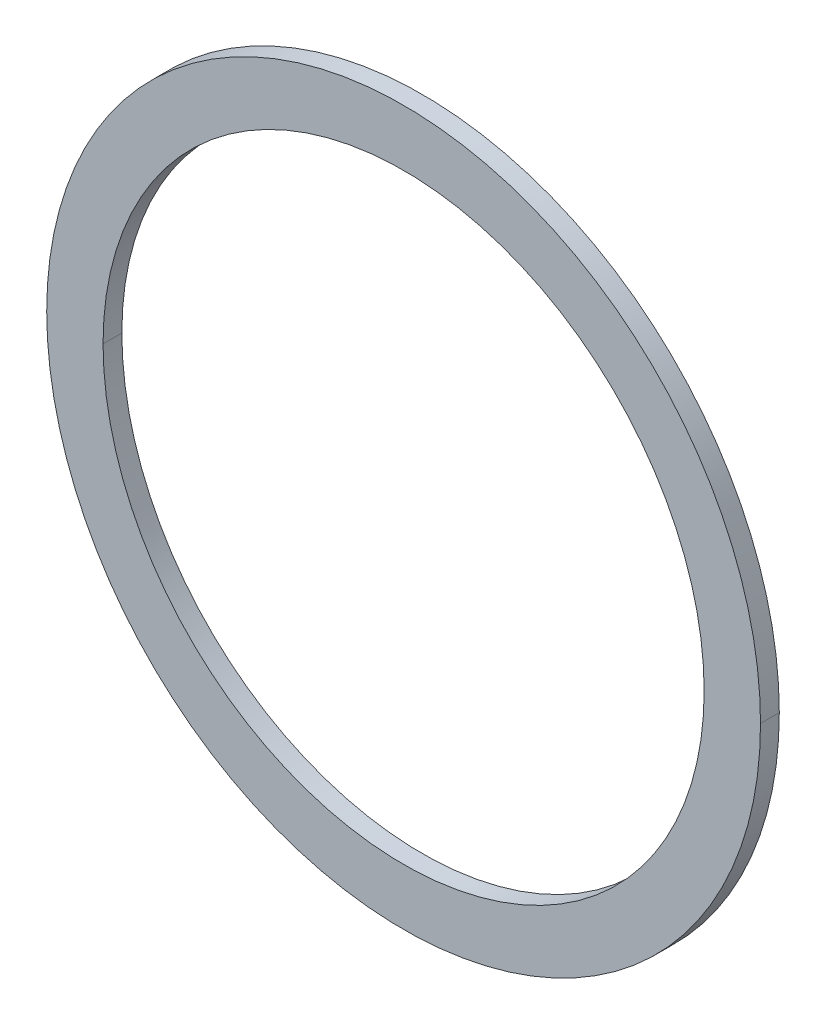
ISO-10303-21;
HEADER;
FILE_DESCRIPTION(('STEP AP214'),'2;1');
FILE_NAME('part.step','',(''),(''),'','','');
FILE_SCHEMA(('AUTOMOTIVE_DESIGN { 1 0 10303 214 1 1 1 1 }'));
ENDSEC;
DATA;
#1=APPLICATION_CONTEXT('core data for automotive mechanical design processes');
#2=APPLICATION_PROTOCOL_DEFINITION('international standard','automotive_design',2000,#1);
#3=PRODUCT_CONTEXT('',#1,'mechanical');
#4=PRODUCT('Part','Part','',(#3));
#5=PRODUCT_RELATED_PRODUCT_CATEGORY('part','',(#4));
#6=PRODUCT_DEFINITION_FORMATION('','',#4);
#7=PRODUCT_DEFINITION_CONTEXT('part definition',#1,'design');
#8=PRODUCT_DEFINITION('design','',#6,#7);
#9=PRODUCT_DEFINITION_SHAPE('','',#8);
#10=(LENGTH_UNIT() NAMED_UNIT(*) SI_UNIT(.MILLI.,.METRE.));
#11=(NAMED_UNIT(*) PLANE_ANGLE_UNIT() SI_UNIT($,.RADIAN.));
#12=(NAMED_UNIT(*) SI_UNIT($,.STERADIAN.) SOLID_ANGLE_UNIT());
#13=UNCERTAINTY_MEASURE_WITH_UNIT(LENGTH_MEASURE(1.E-05),#10,'distance_accuracy_value','');
#14=(GEOMETRIC_REPRESENTATION_CONTEXT(3) GLOBAL_UNCERTAINTY_ASSIGNED_CONTEXT((#13)) GLOBAL_UNIT_ASSIGNED_CONTEXT((#10,
#11,#12)) REPRESENTATION_CONTEXT('',''));
#15=CARTESIAN_POINT('',(0.,0.,0.));
#16=DIRECTION('',(0.,0.,1.));
#17=DIRECTION('',(1.,0.,0.));
#18=AXIS2_PLACEMENT_3D('',#15,#16,#17);
#19=CARTESIAN_POINT('',(0.,0.,0.));
#20=DIRECTION('',(0.,0.,-1.));
#21=DIRECTION('',(-1.,0.,0.));
#22=AXIS2_PLACEMENT_3D('',#19,#20,#21);
#23=CYLINDRICAL_SURFACE('',#22,16.);
#24=DIRECTION('',(0.,0.,-1.));
#25=VECTOR('',#24,1.);
#26=CARTESIAN_POINT('',(16.,0.,0.));
#27=LINE('',#26,#25);
#28=CARTESIAN_POINT('',(16.,0.,0.));
#29=VERTEX_POINT('',#28);
#30=CARTESIAN_POINT('',(16.,0.,-1.));
#31=VERTEX_POINT('',#30);
#32=EDGE_CURVE('E70',#29,#31,#27,.T.);
#33=ORIENTED_EDGE('',*,*,#32,.F.);
#34=CARTESIAN_POINT('',(0.,0.,0.));
#35=DIRECTION('',(0.,0.,1.));
#36=DIRECTION('',(1.,0.,0.));
#37=AXIS2_PLACEMENT_3D('',#34,#35,#36);
#38=CIRCLE('',#37,16.);
#39=CARTESIAN_POINT('',(-16.,0.,0.));
#40=VERTEX_POINT('',#39);
#41=EDGE_CURVE('E65',#29,#40,#38,.T.);
#42=ORIENTED_EDGE('',*,*,#41,.T.);
#43=DIRECTION('',(0.,0.,-1.));
#44=VECTOR('',#43,1.);
#45=CARTESIAN_POINT('',(-16.,0.,0.));
#46=LINE('',#45,#44);
#47=CARTESIAN_POINT('',(-16.,0.,-1.));
#48=VERTEX_POINT('',#47);
#49=EDGE_CURVE('E67',#40,#48,#46,.T.);
#50=ORIENTED_EDGE('',*,*,#49,.T.);
#51=CARTESIAN_POINT('',(0.,0.,-1.));
#52=DIRECTION('',(0.,0.,1.));
#53=DIRECTION('',(1.,0.,0.));
#54=AXIS2_PLACEMENT_3D('',#51,#52,#53);
#55=CIRCLE('',#54,16.);
#56=EDGE_CURVE('E10',#31,#48,#55,.T.);
#57=ORIENTED_EDGE('',*,*,#56,.F.);
#58=EDGE_LOOP('',(#33,#42,#50,#57));
#59=FACE_BOUND('',#58,.T.);
#60=ADVANCED_FACE('F15',(#59),#23,.F.);
#61=CARTESIAN_POINT('',(0.,0.,0.));
#62=DIRECTION('',(0.,0.,-1.));
#63=DIRECTION('',(-1.,0.,0.));
#64=AXIS2_PLACEMENT_3D('',#61,#62,#63);
#65=CYLINDRICAL_SURFACE('',#64,19.);
#66=DIRECTION('',(0.,0.,-1.));
#67=VECTOR('',#66,1.);
#68=CARTESIAN_POINT('',(19.,0.,0.));
#69=LINE('',#68,#67);
#70=CARTESIAN_POINT('',(19.,0.,0.));
#71=VERTEX_POINT('',#70);
#72=CARTESIAN_POINT('',(19.,0.,-1.));
#73=VERTEX_POINT('',#72);
#74=EDGE_CURVE('E99',#71,#73,#69,.T.);
#75=ORIENTED_EDGE('',*,*,#74,.F.);
#76=CARTESIAN_POINT('',(0.,0.,0.));
#77=DIRECTION('',(0.,0.,1.));
#78=DIRECTION('',(1.,0.,0.));
#79=AXIS2_PLACEMENT_3D('',#76,#77,#78);
#80=CIRCLE('',#79,19.);
#81=CARTESIAN_POINT('',(-19.,0.,0.));
#82=VERTEX_POINT('',#81);
#83=EDGE_CURVE('E75',#82,#71,#80,.T.);
#84=ORIENTED_EDGE('',*,*,#83,.F.);
#85=DIRECTION('',(0.,0.,-1.));
#86=VECTOR('',#85,1.);
#87=CARTESIAN_POINT('',(-19.,0.,0.));
#88=LINE('',#87,#86);
#89=CARTESIAN_POINT('',(-19.,0.,-1.));
#90=VERTEX_POINT('',#89);
#91=EDGE_CURVE('E107',#82,#90,#88,.T.);
#92=ORIENTED_EDGE('',*,*,#91,.T.);
#93=CARTESIAN_POINT('',(0.,0.,-1.));
#94=DIRECTION('',(0.,0.,1.));
#95=DIRECTION('',(1.,0.,0.));
#96=AXIS2_PLACEMENT_3D('',#93,#94,#95);
#97=CIRCLE('',#96,19.);
#98=EDGE_CURVE('E23',#90,#73,#97,.T.);
#99=ORIENTED_EDGE('',*,*,#98,.T.);
#100=EDGE_LOOP('',(#75,#84,#92,#99));
#101=FACE_BOUND('',#100,.T.);
#102=ADVANCED_FACE('F114',(#101),#65,.T.);
#103=CARTESIAN_POINT('',(0.,0.,-1.));
#104=DIRECTION('',(0.,0.,1.));
#105=DIRECTION('',(0.,1.,0.));
#106=AXIS2_PLACEMENT_3D('',#103,#104,#105);
#107=PLANE('',#106);
#108=CARTESIAN_POINT('',(0.,0.,-1.));
#109=DIRECTION('',(0.,0.,1.));
#110=DIRECTION('',(1.,0.,0.));
#111=AXIS2_PLACEMENT_3D('',#108,#109,#110);
#112=CIRCLE('',#111,16.);
#113=EDGE_CURVE('E80',#48,#31,#112,.T.);
#114=ORIENTED_EDGE('',*,*,#113,.T.);
#115=ORIENTED_EDGE('',*,*,#56,.T.);
#116=EDGE_LOOP('',(#114,#115));
#117=FACE_BOUND('',#116,.T.);
#118=ORIENTED_EDGE('',*,*,#98,.F.);
#119=CARTESIAN_POINT('',(0.,0.,-1.));
#120=DIRECTION('',(0.,0.,1.));
#121=DIRECTION('',(1.,0.,0.));
#122=AXIS2_PLACEMENT_3D('',#119,#120,#121);
#123=CIRCLE('',#122,19.);
#124=EDGE_CURVE('E103',#73,#90,#123,.T.);
#125=ORIENTED_EDGE('',*,*,#124,.F.);
#126=EDGE_LOOP('',(#118,#125));
#127=FACE_BOUND('',#126,.T.);
#128=ADVANCED_FACE('F117',(#117,#127),#107,.F.);
#129=CARTESIAN_POINT('',(0.,0.,0.));
#130=DIRECTION('',(0.,0.,1.));
#131=DIRECTION('',(0.,1.,0.));
#132=AXIS2_PLACEMENT_3D('',#129,#130,#131);
#133=PLANE('',#132);
#134=CARTESIAN_POINT('',(0.,0.,0.));
#135=DIRECTION('',(0.,0.,1.));
#136=DIRECTION('',(1.,0.,0.));
#137=AXIS2_PLACEMENT_3D('',#134,#135,#136);
#138=CIRCLE('',#137,16.);
#139=EDGE_CURVE('E78',#40,#29,#138,.T.);
#140=ORIENTED_EDGE('',*,*,#139,.F.);
#141=ORIENTED_EDGE('',*,*,#41,.F.);
#142=EDGE_LOOP('',(#140,#141));
#143=FACE_BOUND('',#142,.T.);
#144=ORIENTED_EDGE('',*,*,#83,.T.);
#145=CARTESIAN_POINT('',(0.,0.,0.));
#146=DIRECTION('',(0.,0.,1.));
#147=DIRECTION('',(1.,0.,0.));
#148=AXIS2_PLACEMENT_3D('',#145,#146,#147);
#149=CIRCLE('',#148,19.);
#150=EDGE_CURVE('E82',#71,#82,#149,.T.);
#151=ORIENTED_EDGE('',*,*,#150,.T.);
#152=EDGE_LOOP('',(#144,#151));
#153=FACE_BOUND('',#152,.T.);
#154=ADVANCED_FACE('F84',(#143,#153),#133,.T.);
#155=CARTESIAN_POINT('',(0.,0.,0.));
#156=DIRECTION('',(0.,0.,-1.));
#157=DIRECTION('',(-1.,0.,0.));
#158=AXIS2_PLACEMENT_3D('',#155,#156,#157);
#159=CYLINDRICAL_SURFACE('',#158,19.);
#160=ORIENTED_EDGE('',*,*,#150,.F.);
#161=ORIENTED_EDGE('',*,*,#74,.T.);
#162=ORIENTED_EDGE('',*,*,#124,.T.);
#163=ORIENTED_EDGE('',*,*,#91,.F.);
#164=EDGE_LOOP('',(#160,#161,#162,#163));
#165=FACE_BOUND('',#164,.T.);
#166=ADVANCED_FACE('F116',(#165),#159,.T.);
#167=CARTESIAN_POINT('',(0.,0.,0.));
#168=DIRECTION('',(0.,0.,-1.));
#169=DIRECTION('',(-1.,0.,0.));
#170=AXIS2_PLACEMENT_3D('',#167,#168,#169);
#171=CYLINDRICAL_SURFACE('',#170,16.);
#172=ORIENTED_EDGE('',*,*,#139,.T.);
#173=ORIENTED_EDGE('',*,*,#32,.T.);
#174=ORIENTED_EDGE('',*,*,#113,.F.);
#175=ORIENTED_EDGE('',*,*,#49,.F.);
#176=EDGE_LOOP('',(#172,#173,#174,#175));
#177=FACE_BOUND('',#176,.T.);
#178=ADVANCED_FACE('F77',(#177),#171,.F.);
#179=CLOSED_SHELL('',(#60,#102,#128,#154,#166,#178));
#180=MANIFOLD_SOLID_BREP('B1',#179);
#181=ADVANCED_BREP_SHAPE_REPRESENTATION('',(#18,#180),#14);
#182=SHAPE_DEFINITION_REPRESENTATION(#9,#181);
ENDSEC;
END-ISO-10303-21;
